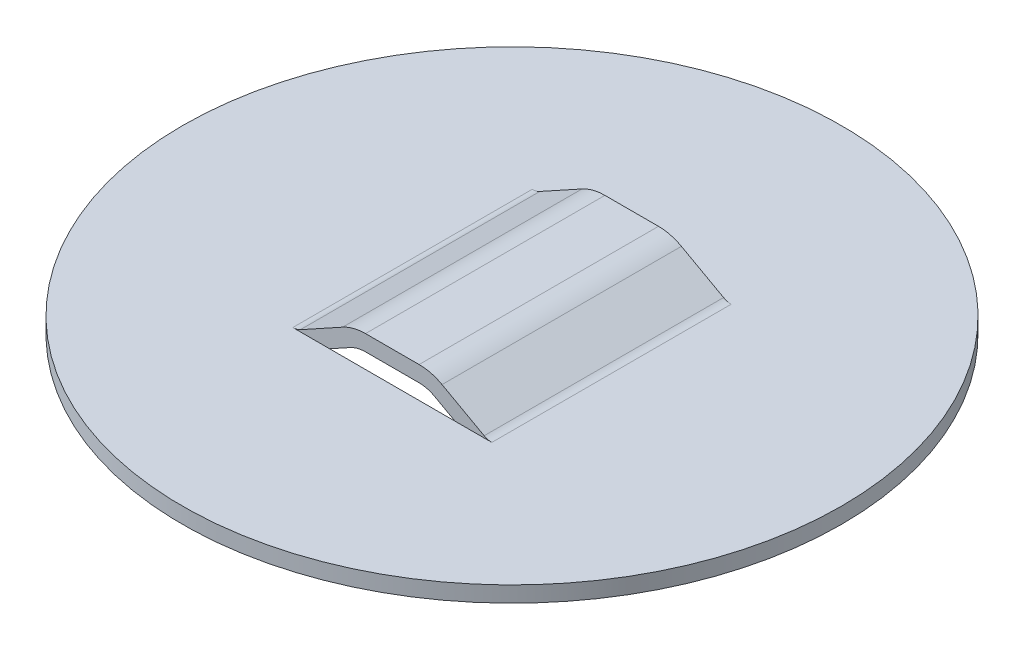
ISO-10303-21;
HEADER;
FILE_DESCRIPTION(('STEP AP214'),'2;1');
FILE_NAME('part.step','',(''),(''),'','','');
FILE_SCHEMA(('AUTOMOTIVE_DESIGN { 1 0 10303 214 1 1 1 1 }'));
ENDSEC;
DATA;
#1=APPLICATION_CONTEXT('core data for automotive mechanical design processes');
#2=APPLICATION_PROTOCOL_DEFINITION('international standard','automotive_design',2000,#1);
#3=PRODUCT_CONTEXT('',#1,'mechanical');
#4=PRODUCT('Part','Part','',(#3));
#5=PRODUCT_RELATED_PRODUCT_CATEGORY('part','',(#4));
#6=PRODUCT_DEFINITION_FORMATION('','',#4);
#7=PRODUCT_DEFINITION_CONTEXT('part definition',#1,'design');
#8=PRODUCT_DEFINITION('design','',#6,#7);
#9=PRODUCT_DEFINITION_SHAPE('','',#8);
#10=(LENGTH_UNIT() NAMED_UNIT(*) SI_UNIT(.MILLI.,.METRE.));
#11=(NAMED_UNIT(*) PLANE_ANGLE_UNIT() SI_UNIT($,.RADIAN.));
#12=(NAMED_UNIT(*) SI_UNIT($,.STERADIAN.) SOLID_ANGLE_UNIT());
#13=UNCERTAINTY_MEASURE_WITH_UNIT(LENGTH_MEASURE(1.E-05),#10,'distance_accuracy_value','');
#14=(GEOMETRIC_REPRESENTATION_CONTEXT(3) GLOBAL_UNCERTAINTY_ASSIGNED_CONTEXT((#13)) GLOBAL_UNIT_ASSIGNED_CONTEXT((#10,
#11,#12)) REPRESENTATION_CONTEXT('',''));
#15=CARTESIAN_POINT('',(0.,0.,0.));
#16=DIRECTION('',(0.,0.,1.));
#17=DIRECTION('',(1.,0.,0.));
#18=AXIS2_PLACEMENT_3D('',#15,#16,#17);
#19=CARTESIAN_POINT('',(1.29111466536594,0.7366,11.5316));
#20=DIRECTION('',(0.,1.,0.));
#21=DIRECTION('',(-1.,0.,0.));
#22=AXIS2_PLACEMENT_3D('',#19,#20,#21);
#23=PLANE('',#22);
#24=DIRECTION('',(0.,0.,-1.));
#25=VECTOR('',#24,1.);
#26=CARTESIAN_POINT('',(1.29111466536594,0.7366,11.5316));
#27=LINE('',#26,#25);
#28=CARTESIAN_POINT('',(1.29111466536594,0.7366,0.));
#29=VERTEX_POINT('',#28);
#30=CARTESIAN_POINT('',(1.29111466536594,0.7366,11.5316));
#31=VERTEX_POINT('',#30);
#32=EDGE_CURVE('E137',#29,#31,#27,.F.);
#33=ORIENTED_EDGE('',*,*,#32,.T.);
#34=DIRECTION('',(-1.,0.,0.));
#35=VECTOR('',#34,1.);
#36=CARTESIAN_POINT('',(-1.29111466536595,0.7366,11.5316));
#37=LINE('',#36,#35);
#38=CARTESIAN_POINT('',(-1.29111466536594,0.7366,11.5316));
#39=VERTEX_POINT('',#38);
#40=EDGE_CURVE('E195',#31,#39,#37,.T.);
#41=ORIENTED_EDGE('',*,*,#40,.T.);
#42=DIRECTION('',(0.,0.,-1.));
#43=VECTOR('',#42,1.);
#44=CARTESIAN_POINT('',(-1.29111466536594,0.7366,11.5316));
#45=LINE('',#44,#43);
#46=CARTESIAN_POINT('',(-1.29111466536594,0.7366,0.));
#47=VERTEX_POINT('',#46);
#48=EDGE_CURVE('E155',#39,#47,#45,.T.);
#49=ORIENTED_EDGE('',*,*,#48,.T.);
#50=DIRECTION('',(-1.,0.,0.));
#51=VECTOR('',#50,1.);
#52=CARTESIAN_POINT('',(-1.29111466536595,0.7366,0.));
#53=LINE('',#52,#51);
#54=EDGE_CURVE('E157',#29,#47,#53,.T.);
#55=ORIENTED_EDGE('',*,*,#54,.F.);
#56=EDGE_LOOP('',(#33,#41,#49,#55));
#57=FACE_BOUND('',#56,.T.);
#58=ADVANCED_FACE('F18',(#57),#23,.F.);
#59=CARTESIAN_POINT('',(-4.5974,0.,11.5316));
#60=DIRECTION('',(0.48286097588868,-0.875697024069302,0.));
#61=DIRECTION('',(0.875697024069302,0.48286097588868,0.));
#62=AXIS2_PLACEMENT_3D('',#59,#60,#61);
#63=PLANE('',#62);
#64=DIRECTION('',(0.,0.,1.));
#65=VECTOR('',#64,1.);
#66=CARTESIAN_POINT('',(-4.42562171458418,0.0947188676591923,11.5316));
#67=LINE('',#66,#65);
#68=CARTESIAN_POINT('',(-4.42562171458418,0.094718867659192,0.));
#69=VERTEX_POINT('',#68);
#70=CARTESIAN_POINT('',(-4.42562171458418,0.094718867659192,11.5316));
#71=VERTEX_POINT('',#70);
#72=EDGE_CURVE('E138',#69,#71,#67,.T.);
#73=ORIENTED_EDGE('',*,*,#72,.T.);
#74=DIRECTION('',(0.875697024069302,0.48286097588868,0.));
#75=VECTOR('',#74,1.);
#76=CARTESIAN_POINT('',(-4.42562171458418,0.0947188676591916,11.5316));
#77=LINE('',#76,#75);
#78=CARTESIAN_POINT('',(-2.39493485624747,1.21444339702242,11.5316));
#79=VERTEX_POINT('',#78);
#80=EDGE_CURVE('E188',#71,#79,#77,.T.);
#81=ORIENTED_EDGE('',*,*,#80,.T.);
#82=DIRECTION('',(0.,0.,-1.));
#83=VECTOR('',#82,1.);
#84=CARTESIAN_POINT('',(-2.39493485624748,1.21444339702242,11.5316));
#85=LINE('',#84,#83);
#86=CARTESIAN_POINT('',(-2.39493485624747,1.21444339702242,0.));
#87=VERTEX_POINT('',#86);
#88=EDGE_CURVE('E275',#87,#79,#85,.F.);
#89=ORIENTED_EDGE('',*,*,#88,.F.);
#90=DIRECTION('',(0.875697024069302,0.48286097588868,0.));
#91=VECTOR('',#90,1.);
#92=CARTESIAN_POINT('',(-4.42562171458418,0.0947188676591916,0.));
#93=LINE('',#92,#91);
#94=EDGE_CURVE('E202',#69,#87,#93,.T.);
#95=ORIENTED_EDGE('',*,*,#94,.F.);
#96=EDGE_LOOP('',(#73,#81,#89,#95));
#97=FACE_BOUND('',#96,.T.);
#98=ADVANCED_FACE('F290',(#97),#63,.F.);
#99=CARTESIAN_POINT('',(-1.29111466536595,-0.7874,11.5316));
#100=DIRECTION('',(0.,0.,-1.));
#101=DIRECTION('',(-1.,0.,0.));
#102=AXIS2_PLACEMENT_3D('',#99,#100,#101);
#103=CYLINDRICAL_SURFACE('',#102,2.286);
#104=CARTESIAN_POINT('',(-1.29111466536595,-0.7874,11.5316));
#105=DIRECTION('',(0.,0.,-1.));
#106=DIRECTION('',(-1.,0.,0.));
#107=AXIS2_PLACEMENT_3D('',#104,#105,#106);
#108=CIRCLE('',#107,2.286);
#109=CARTESIAN_POINT('',(-1.29111466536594,1.4986,11.5316));
#110=VERTEX_POINT('',#109);
#111=EDGE_CURVE('E185',#79,#110,#108,.T.);
#112=ORIENTED_EDGE('',*,*,#111,.T.);
#113=DIRECTION('',(0.,0.,-1.));
#114=VECTOR('',#113,1.);
#115=CARTESIAN_POINT('',(-1.29111466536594,1.4986,11.5316));
#116=LINE('',#115,#114);
#117=CARTESIAN_POINT('',(-1.29111466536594,1.4986,0.));
#118=VERTEX_POINT('',#117);
#119=EDGE_CURVE('E273',#110,#118,#116,.T.);
#120=ORIENTED_EDGE('',*,*,#119,.T.);
#121=CARTESIAN_POINT('',(-1.29111466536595,-0.7874,0.));
#122=DIRECTION('',(0.,0.,-1.));
#123=DIRECTION('',(-1.,0.,0.));
#124=AXIS2_PLACEMENT_3D('',#121,#122,#123);
#125=CIRCLE('',#124,2.286);
#126=EDGE_CURVE('E200',#87,#118,#125,.T.);
#127=ORIENTED_EDGE('',*,*,#126,.F.);
#128=ORIENTED_EDGE('',*,*,#88,.T.);
#129=EDGE_LOOP('',(#112,#120,#127,#128));
#130=FACE_BOUND('',#129,.T.);
#131=ADVANCED_FACE('F280',(#130),#103,.T.);
#132=CARTESIAN_POINT('',(-1.29111466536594,1.4986,11.5316));
#133=DIRECTION('',(0.,-1.,0.));
#134=DIRECTION('',(0.,0.,-1.));
#135=AXIS2_PLACEMENT_3D('',#132,#133,#134);
#136=PLANE('',#135);
#137=ORIENTED_EDGE('',*,*,#119,.F.);
#138=DIRECTION('',(-1.,0.,0.));
#139=VECTOR('',#138,1.);
#140=CARTESIAN_POINT('',(-1.29111466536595,1.4986,11.5316));
#141=LINE('',#140,#139);
#142=CARTESIAN_POINT('',(1.29111466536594,1.4986,11.5316));
#143=VERTEX_POINT('',#142);
#144=EDGE_CURVE('E184',#110,#143,#141,.F.);
#145=ORIENTED_EDGE('',*,*,#144,.T.);
#146=DIRECTION('',(0.,0.,-1.));
#147=VECTOR('',#146,1.);
#148=CARTESIAN_POINT('',(1.29111466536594,1.4986,11.5316));
#149=LINE('',#148,#147);
#150=CARTESIAN_POINT('',(1.29111466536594,1.4986,0.));
#151=VERTEX_POINT('',#150);
#152=EDGE_CURVE('E271',#151,#143,#149,.F.);
#153=ORIENTED_EDGE('',*,*,#152,.F.);
#154=DIRECTION('',(-1.,0.,0.));
#155=VECTOR('',#154,1.);
#156=CARTESIAN_POINT('',(-1.29111466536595,1.4986,0.));
#157=LINE('',#156,#155);
#158=EDGE_CURVE('E199',#118,#151,#157,.F.);
#159=ORIENTED_EDGE('',*,*,#158,.F.);
#160=EDGE_LOOP('',(#137,#145,#153,#159));
#161=FACE_BOUND('',#160,.T.);
#162=ADVANCED_FACE('F321',(#161),#136,.F.);
#163=CARTESIAN_POINT('',(1.29111466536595,-0.787399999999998,11.5316));
#164=DIRECTION('',(0.,0.,-1.));
#165=DIRECTION('',(-1.,0.,0.));
#166=AXIS2_PLACEMENT_3D('',#163,#164,#165);
#167=CYLINDRICAL_SURFACE('',#166,2.286);
#168=CARTESIAN_POINT('',(1.29111466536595,-0.787399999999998,11.5316));
#169=DIRECTION('',(0.,0.,-1.));
#170=DIRECTION('',(-1.,0.,0.));
#171=AXIS2_PLACEMENT_3D('',#168,#169,#170);
#172=CIRCLE('',#171,2.286);
#173=CARTESIAN_POINT('',(2.39493485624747,1.21444339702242,11.5316));
#174=VERTEX_POINT('',#173);
#175=EDGE_CURVE('E181',#143,#174,#172,.T.);
#176=ORIENTED_EDGE('',*,*,#175,.T.);
#177=DIRECTION('',(0.,0.,1.));
#178=VECTOR('',#177,1.);
#179=CARTESIAN_POINT('',(2.39493485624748,1.21444339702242,11.5316));
#180=LINE('',#179,#178);
#181=CARTESIAN_POINT('',(2.39493485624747,1.21444339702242,0.));
#182=VERTEX_POINT('',#181);
#183=EDGE_CURVE('E269',#174,#182,#180,.F.);
#184=ORIENTED_EDGE('',*,*,#183,.T.);
#185=CARTESIAN_POINT('',(1.29111466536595,-0.787399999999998,0.));
#186=DIRECTION('',(0.,0.,-1.));
#187=DIRECTION('',(-1.,0.,0.));
#188=AXIS2_PLACEMENT_3D('',#185,#186,#187);
#189=CIRCLE('',#188,2.286);
#190=EDGE_CURVE('E146',#151,#182,#189,.T.);
#191=ORIENTED_EDGE('',*,*,#190,.F.);
#192=ORIENTED_EDGE('',*,*,#152,.T.);
#193=EDGE_LOOP('',(#176,#184,#191,#192));
#194=FACE_BOUND('',#193,.T.);
#195=ADVANCED_FACE('F323',(#194),#167,.T.);
#196=CARTESIAN_POINT('',(4.5974,0.,11.5316));
#197=DIRECTION('',(-0.48286097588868,-0.875697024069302,0.));
#198=DIRECTION('',(0.875697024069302,-0.48286097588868,0.));
#199=AXIS2_PLACEMENT_3D('',#196,#197,#198);
#200=PLANE('',#199);
#201=DIRECTION('',(0.,0.,1.));
#202=VECTOR('',#201,1.);
#203=CARTESIAN_POINT('',(4.42562171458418,0.094718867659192,11.5316));
#204=LINE('',#203,#202);
#205=CARTESIAN_POINT('',(4.42562171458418,0.0947188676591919,11.5316));
#206=VERTEX_POINT('',#205);
#207=CARTESIAN_POINT('',(4.42562171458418,0.0947188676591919,0.));
#208=VERTEX_POINT('',#207);
#209=EDGE_CURVE('E128',#206,#208,#204,.F.);
#210=ORIENTED_EDGE('',*,*,#209,.T.);
#211=DIRECTION('',(0.875697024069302,-0.482860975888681,0.));
#212=VECTOR('',#211,1.);
#213=CARTESIAN_POINT('',(2.39493485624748,1.21444339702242,0.));
#214=LINE('',#213,#212);
#215=EDGE_CURVE('E131',#182,#208,#214,.T.);
#216=ORIENTED_EDGE('',*,*,#215,.F.);
#217=ORIENTED_EDGE('',*,*,#183,.F.);
#218=DIRECTION('',(0.875697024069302,-0.482860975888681,0.));
#219=VECTOR('',#218,1.);
#220=CARTESIAN_POINT('',(2.39493485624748,1.21444339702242,11.5316));
#221=LINE('',#220,#219);
#222=EDGE_CURVE('E133',#174,#206,#221,.T.);
#223=ORIENTED_EDGE('',*,*,#222,.T.);
#224=EDGE_LOOP('',(#210,#216,#217,#223));
#225=FACE_BOUND('',#224,.T.);
#226=ADVANCED_FACE('F130',(#225),#200,.F.);
#227=CARTESIAN_POINT('',(-4.79356177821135,0.762,11.5316));
#228=DIRECTION('',(0.,0.,1.));
#229=DIRECTION('',(1.,0.,0.));
#230=AXIS2_PLACEMENT_3D('',#227,#228,#229);
#231=CYLINDRICAL_SURFACE('',#230,0.762);
#232=ORIENTED_EDGE('',*,*,#72,.F.);
#233=CARTESIAN_POINT('',(-4.79356177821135,0.762,0.));
#234=DIRECTION('',(0.,0.,1.));
#235=DIRECTION('',(1.,0.,0.));
#236=AXIS2_PLACEMENT_3D('',#233,#234,#235);
#237=CIRCLE('',#236,0.762);
#238=CARTESIAN_POINT('',(-4.79356177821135,0.,0.));
#239=VERTEX_POINT('',#238);
#240=EDGE_CURVE('E203',#239,#69,#237,.T.);
#241=ORIENTED_EDGE('',*,*,#240,.F.);
#242=DIRECTION('',(0.,0.,1.));
#243=VECTOR('',#242,1.);
#244=CARTESIAN_POINT('',(-4.79356177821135,0.,11.5316));
#245=LINE('',#244,#243);
#246=CARTESIAN_POINT('',(-4.79356177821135,0.,11.5316));
#247=VERTEX_POINT('',#246);
#248=EDGE_CURVE('E226',#239,#247,#245,.T.);
#249=ORIENTED_EDGE('',*,*,#248,.T.);
#250=CARTESIAN_POINT('',(-4.79356177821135,0.762,11.5316));
#251=DIRECTION('',(0.,0.,1.));
#252=DIRECTION('',(1.,0.,0.));
#253=AXIS2_PLACEMENT_3D('',#250,#251,#252);
#254=CIRCLE('',#253,0.762);
#255=EDGE_CURVE('E189',#247,#71,#254,.T.);
#256=ORIENTED_EDGE('',*,*,#255,.T.);
#257=EDGE_LOOP('',(#232,#241,#249,#256));
#258=FACE_BOUND('',#257,.T.);
#259=ADVANCED_FACE('F354',(#258),#231,.F.);
#260=CARTESIAN_POINT('',(4.79356177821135,0.761999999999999,11.5316));
#261=DIRECTION('',(0.,0.,1.));
#262=DIRECTION('',(1.,0.,0.));
#263=AXIS2_PLACEMENT_3D('',#260,#261,#262);
#264=CYLINDRICAL_SURFACE('',#263,0.762);
#265=DIRECTION('',(0.,0.,1.));
#266=VECTOR('',#265,1.);
#267=CARTESIAN_POINT('',(4.79356177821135,0.,11.5316));
#268=LINE('',#267,#266);
#269=CARTESIAN_POINT('',(4.79356177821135,0.,11.5316));
#270=VERTEX_POINT('',#269);
#271=CARTESIAN_POINT('',(4.79356177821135,0.,0.));
#272=VERTEX_POINT('',#271);
#273=EDGE_CURVE('E153',#270,#272,#268,.F.);
#274=ORIENTED_EDGE('',*,*,#273,.T.);
#275=CARTESIAN_POINT('',(4.79356177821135,0.761999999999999,0.));
#276=DIRECTION('',(0.,0.,1.));
#277=DIRECTION('',(1.,0.,0.));
#278=AXIS2_PLACEMENT_3D('',#275,#276,#277);
#279=CIRCLE('',#278,0.762);
#280=EDGE_CURVE('E21',#208,#272,#279,.T.);
#281=ORIENTED_EDGE('',*,*,#280,.F.);
#282=ORIENTED_EDGE('',*,*,#209,.F.);
#283=CARTESIAN_POINT('',(4.79356177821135,0.761999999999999,11.5316));
#284=DIRECTION('',(0.,0.,1.));
#285=DIRECTION('',(1.,0.,0.));
#286=AXIS2_PLACEMENT_3D('',#283,#284,#285);
#287=CIRCLE('',#286,0.762);
#288=EDGE_CURVE('E178',#206,#270,#287,.T.);
#289=ORIENTED_EDGE('',*,*,#288,.T.);
#290=EDGE_LOOP('',(#274,#281,#282,#289));
#291=FACE_BOUND('',#290,.T.);
#292=ADVANCED_FACE('F151',(#291),#264,.F.);
#293=CARTESIAN_POINT('',(1.29111466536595,-0.787399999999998,11.5316));
#294=DIRECTION('',(0.,0.,-1.));
#295=DIRECTION('',(-1.,0.,0.));
#296=AXIS2_PLACEMENT_3D('',#293,#294,#295);
#297=CYLINDRICAL_SURFACE('',#296,1.524);
#298=DIRECTION('',(0.,0.,1.));
#299=VECTOR('',#298,1.);
#300=CARTESIAN_POINT('',(2.0269947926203,0.547162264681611,11.5316));
#301=LINE('',#300,#299);
#302=CARTESIAN_POINT('',(2.0269947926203,0.547162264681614,0.));
#303=VERTEX_POINT('',#302);
#304=CARTESIAN_POINT('',(2.0269947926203,0.547162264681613,11.5316));
#305=VERTEX_POINT('',#304);
#306=EDGE_CURVE('E176',#303,#305,#301,.T.);
#307=ORIENTED_EDGE('',*,*,#306,.T.);
#308=CARTESIAN_POINT('',(1.29111466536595,-0.787399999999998,11.5316));
#309=DIRECTION('',(0.,0.,-1.));
#310=DIRECTION('',(-1.,0.,0.));
#311=AXIS2_PLACEMENT_3D('',#308,#309,#310);
#312=CIRCLE('',#311,1.524);
#313=EDGE_CURVE('E148',#305,#31,#312,.F.);
#314=ORIENTED_EDGE('',*,*,#313,.T.);
#315=ORIENTED_EDGE('',*,*,#32,.F.);
#316=CARTESIAN_POINT('',(1.29111466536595,-0.787399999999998,0.));
#317=DIRECTION('',(0.,0.,-1.));
#318=DIRECTION('',(-1.,0.,0.));
#319=AXIS2_PLACEMENT_3D('',#316,#317,#318);
#320=CIRCLE('',#319,1.524);
#321=EDGE_CURVE('E154',#303,#29,#320,.F.);
#322=ORIENTED_EDGE('',*,*,#321,.F.);
#323=EDGE_LOOP('',(#307,#314,#315,#322));
#324=FACE_BOUND('',#323,.T.);
#325=ADVANCED_FACE('F344',(#324),#297,.F.);
#326=CARTESIAN_POINT('',(-1.29111466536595,-0.7874,11.5316));
#327=DIRECTION('',(0.,0.,-1.));
#328=DIRECTION('',(-1.,0.,0.));
#329=AXIS2_PLACEMENT_3D('',#326,#327,#328);
#330=CYLINDRICAL_SURFACE('',#329,1.524);
#331=ORIENTED_EDGE('',*,*,#48,.F.);
#332=CARTESIAN_POINT('',(-1.29111466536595,-0.7874,11.5316));
#333=DIRECTION('',(0.,0.,-1.));
#334=DIRECTION('',(-1.,0.,0.));
#335=AXIS2_PLACEMENT_3D('',#332,#333,#334);
#336=CIRCLE('',#335,1.524);
#337=CARTESIAN_POINT('',(-2.0269947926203,0.547162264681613,11.5316));
#338=VERTEX_POINT('',#337);
#339=EDGE_CURVE('E192',#39,#338,#336,.F.);
#340=ORIENTED_EDGE('',*,*,#339,.T.);
#341=DIRECTION('',(0.,0.,1.));
#342=VECTOR('',#341,1.);
#343=CARTESIAN_POINT('',(-2.0269947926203,0.547162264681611,11.5316));
#344=LINE('',#343,#342);
#345=CARTESIAN_POINT('',(-2.0269947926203,0.547162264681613,0.));
#346=VERTEX_POINT('',#345);
#347=EDGE_CURVE('E216',#338,#346,#344,.F.);
#348=ORIENTED_EDGE('',*,*,#347,.T.);
#349=CARTESIAN_POINT('',(-1.29111466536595,-0.7874,0.));
#350=DIRECTION('',(0.,0.,-1.));
#351=DIRECTION('',(-1.,0.,0.));
#352=AXIS2_PLACEMENT_3D('',#349,#350,#351);
#353=CIRCLE('',#352,1.524);
#354=EDGE_CURVE('E206',#47,#346,#353,.F.);
#355=ORIENTED_EDGE('',*,*,#354,.F.);
#356=EDGE_LOOP('',(#331,#340,#348,#355));
#357=FACE_BOUND('',#356,.T.);
#358=ADVANCED_FACE('F387',(#357),#330,.F.);
#359=CARTESIAN_POINT('',(-1.29111466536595,-0.7874,0.));
#360=DIRECTION('',(0.,0.,-1.));
#361=DIRECTION('',(-1.,0.,0.));
#362=AXIS2_PLACEMENT_3D('',#359,#360,#361);
#363=PLANE('',#362);
#364=ORIENTED_EDGE('',*,*,#190,.T.);
#365=ORIENTED_EDGE('',*,*,#215,.T.);
#366=ORIENTED_EDGE('',*,*,#280,.T.);
#367=DIRECTION('',(1.,0.,0.));
#368=VECTOR('',#367,1.);
#369=CARTESIAN_POINT('',(12.242254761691,0.,0.));
#370=LINE('',#369,#368);
#371=CARTESIAN_POINT('',(3.01930601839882,0.,0.));
#372=VERTEX_POINT('',#371);
#373=EDGE_CURVE('E177',#272,#372,#370,.F.);
#374=ORIENTED_EDGE('',*,*,#373,.T.);
#375=DIRECTION('',(-0.875697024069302,0.482860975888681,0.));
#376=VECTOR('',#375,1.);
#377=CARTESIAN_POINT('',(4.40123822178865,-0.762000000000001,0.));
#378=LINE('',#377,#376);
#379=EDGE_CURVE('E244',#372,#303,#378,.T.);
#380=ORIENTED_EDGE('',*,*,#379,.T.);
#381=ORIENTED_EDGE('',*,*,#321,.T.);
#382=ORIENTED_EDGE('',*,*,#54,.T.);
#383=ORIENTED_EDGE('',*,*,#354,.T.);
#384=DIRECTION('',(-0.875697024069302,-0.48286097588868,0.));
#385=VECTOR('',#384,1.);
#386=CARTESIAN_POINT('',(-4.40123822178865,-0.762,0.));
#387=LINE('',#386,#385);
#388=CARTESIAN_POINT('',(-3.01930601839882,0.,0.));
#389=VERTEX_POINT('',#388);
#390=EDGE_CURVE('E213',#346,#389,#387,.T.);
#391=ORIENTED_EDGE('',*,*,#390,.T.);
#392=DIRECTION('',(1.,0.,0.));
#393=VECTOR('',#392,1.);
#394=CARTESIAN_POINT('',(12.242254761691,0.,0.));
#395=LINE('',#394,#393);
#396=EDGE_CURVE('E180',#389,#239,#395,.F.);
#397=ORIENTED_EDGE('',*,*,#396,.T.);
#398=ORIENTED_EDGE('',*,*,#240,.T.);
#399=ORIENTED_EDGE('',*,*,#94,.T.);
#400=ORIENTED_EDGE('',*,*,#126,.T.);
#401=ORIENTED_EDGE('',*,*,#158,.T.);
#402=EDGE_LOOP('',(#364,#365,#366,#374,#380,#381,#382,#383,#391,#397,#398,#399,#400,#401));
#403=FACE_BOUND('',#402,.T.);
#404=ADVANCED_FACE('F142',(#403),#363,.T.);
#405=CARTESIAN_POINT('',(-1.29111466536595,-0.7874,11.5316));
#406=DIRECTION('',(0.,0.,-1.));
#407=DIRECTION('',(-1.,0.,0.));
#408=AXIS2_PLACEMENT_3D('',#405,#406,#407);
#409=PLANE('',#408);
#410=ORIENTED_EDGE('',*,*,#288,.F.);
#411=ORIENTED_EDGE('',*,*,#222,.F.);
#412=ORIENTED_EDGE('',*,*,#175,.F.);
#413=ORIENTED_EDGE('',*,*,#144,.F.);
#414=ORIENTED_EDGE('',*,*,#111,.F.);
#415=ORIENTED_EDGE('',*,*,#80,.F.);
#416=ORIENTED_EDGE('',*,*,#255,.F.);
#417=DIRECTION('',(1.,0.,0.));
#418=VECTOR('',#417,1.);
#419=CARTESIAN_POINT('',(12.242254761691,0.,11.5316));
#420=LINE('',#419,#418);
#421=CARTESIAN_POINT('',(-3.01930601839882,0.,11.5316));
#422=VERTEX_POINT('',#421);
#423=EDGE_CURVE('E232',#247,#422,#420,.T.);
#424=ORIENTED_EDGE('',*,*,#423,.T.);
#425=DIRECTION('',(-0.875697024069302,-0.48286097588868,0.));
#426=VECTOR('',#425,1.);
#427=CARTESIAN_POINT('',(-4.40123822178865,-0.762,11.5316));
#428=LINE('',#427,#426);
#429=EDGE_CURVE('E221',#422,#338,#428,.F.);
#430=ORIENTED_EDGE('',*,*,#429,.T.);
#431=ORIENTED_EDGE('',*,*,#339,.F.);
#432=ORIENTED_EDGE('',*,*,#40,.F.);
#433=ORIENTED_EDGE('',*,*,#313,.F.);
#434=DIRECTION('',(-0.875697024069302,0.482860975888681,0.));
#435=VECTOR('',#434,1.);
#436=CARTESIAN_POINT('',(4.40123822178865,-0.762000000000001,11.5316));
#437=LINE('',#436,#435);
#438=CARTESIAN_POINT('',(3.01930601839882,0.,11.5316));
#439=VERTEX_POINT('',#438);
#440=EDGE_CURVE('E241',#305,#439,#437,.F.);
#441=ORIENTED_EDGE('',*,*,#440,.T.);
#442=DIRECTION('',(1.,0.,0.));
#443=VECTOR('',#442,1.);
#444=CARTESIAN_POINT('',(12.242254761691,0.,11.5316));
#445=LINE('',#444,#443);
#446=EDGE_CURVE('E234',#439,#270,#445,.T.);
#447=ORIENTED_EDGE('',*,*,#446,.T.);
#448=EDGE_LOOP('',(#410,#411,#412,#413,#414,#415,#416,#424,#430,#431,#432,#433,#441,#447));
#449=FACE_BOUND('',#448,.T.);
#450=ADVANCED_FACE('F287',(#449),#409,.F.);
#451=CARTESIAN_POINT('',(12.242254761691,0.,11.5316));
#452=DIRECTION('',(0.,-1.,0.));
#453=DIRECTION('',(1.,0.,0.));
#454=AXIS2_PLACEMENT_3D('',#451,#452,#453);
#455=PLANE('',#454);
#456=ORIENTED_EDGE('',*,*,#373,.F.);
#457=ORIENTED_EDGE('',*,*,#273,.F.);
#458=ORIENTED_EDGE('',*,*,#446,.F.);
#459=DIRECTION('',(1.,0.,0.));
#460=VECTOR('',#459,1.);
#461=CARTESIAN_POINT('',(-1.29111466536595,0.,11.5316));
#462=LINE('',#461,#460);
#463=EDGE_CURVE('E250',#439,#422,#462,.F.);
#464=ORIENTED_EDGE('',*,*,#463,.T.);
#465=ORIENTED_EDGE('',*,*,#423,.F.);
#466=ORIENTED_EDGE('',*,*,#248,.F.);
#467=ORIENTED_EDGE('',*,*,#396,.F.);
#468=DIRECTION('',(1.,0.,0.));
#469=VECTOR('',#468,1.);
#470=CARTESIAN_POINT('',(-1.29111466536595,0.,0.));
#471=LINE('',#470,#469);
#472=EDGE_CURVE('E219',#372,#389,#471,.F.);
#473=ORIENTED_EDGE('',*,*,#472,.F.);
#474=EDGE_LOOP('',(#456,#457,#458,#464,#465,#466,#467,#473));
#475=FACE_BOUND('',#474,.T.);
#476=CARTESIAN_POINT('',(0.,0.,5.7658));
#477=DIRECTION('',(0.,-1.,0.));
#478=DIRECTION('',(1.,0.,0.));
#479=AXIS2_PLACEMENT_3D('',#476,#477,#478);
#480=CIRCLE('',#479,15.875);
#481=CARTESIAN_POINT('',(15.875,0.,5.7658));
#482=VERTEX_POINT('',#481);
#483=EDGE_CURVE('E173',#482,#482,#480,.T.);
#484=ORIENTED_EDGE('',*,*,#483,.F.);
#485=EDGE_LOOP('',(#484));
#486=FACE_BOUND('',#485,.T.);
#487=ADVANCED_FACE('F347',(#475,#486),#455,.F.);
#488=CARTESIAN_POINT('',(0.,0.,5.7658));
#489=DIRECTION('',(0.,-1.,0.));
#490=DIRECTION('',(1.,0.,0.));
#491=AXIS2_PLACEMENT_3D('',#488,#489,#490);
#492=CYLINDRICAL_SURFACE('',#491,15.875);
#493=CARTESIAN_POINT('',(0.,-0.762000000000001,5.7658));
#494=DIRECTION('',(0.,-1.,0.));
#495=DIRECTION('',(1.,0.,0.));
#496=AXIS2_PLACEMENT_3D('',#493,#494,#495);
#497=CIRCLE('',#496,15.875);
#498=CARTESIAN_POINT('',(15.875,-0.761999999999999,5.7658));
#499=VERTEX_POINT('',#498);
#500=EDGE_CURVE('E168',#499,#499,#497,.F.);
#501=ORIENTED_EDGE('',*,*,#500,.T.);
#502=EDGE_LOOP('',(#501));
#503=FACE_BOUND('',#502,.T.);
#504=ORIENTED_EDGE('',*,*,#483,.T.);
#505=EDGE_LOOP('',(#504));
#506=FACE_BOUND('',#505,.T.);
#507=ADVANCED_FACE('F377',(#503,#506),#492,.T.);
#508=CARTESIAN_POINT('',(4.40123822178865,-0.762000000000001,11.5316));
#509=DIRECTION('',(0.482860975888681,0.875697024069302,0.));
#510=DIRECTION('',(-0.875697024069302,0.482860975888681,0.));
#511=AXIS2_PLACEMENT_3D('',#508,#509,#510);
#512=PLANE('',#511);
#513=DIRECTION('',(-0.875697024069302,0.48286097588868,0.));
#514=VECTOR('',#513,1.);
#515=CARTESIAN_POINT('',(4.40123822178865,-0.762000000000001,0.));
#516=LINE('',#515,#514);
#517=CARTESIAN_POINT('',(4.40123822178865,-0.762000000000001,0.));
#518=VERTEX_POINT('',#517);
#519=EDGE_CURVE('E172',#518,#372,#516,.T.);
#520=ORIENTED_EDGE('',*,*,#519,.F.);
#521=DIRECTION('',(0.,0.,1.));
#522=VECTOR('',#521,1.);
#523=CARTESIAN_POINT('',(4.40123822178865,-0.762000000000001,11.5316));
#524=LINE('',#523,#522);
#525=CARTESIAN_POINT('',(4.40123822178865,-0.762000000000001,11.5316));
#526=VERTEX_POINT('',#525);
#527=EDGE_CURVE('E171',#518,#526,#524,.T.);
#528=ORIENTED_EDGE('',*,*,#527,.T.);
#529=DIRECTION('',(-0.875697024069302,0.48286097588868,0.));
#530=VECTOR('',#529,1.);
#531=CARTESIAN_POINT('',(4.40123822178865,-0.762000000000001,11.5316));
#532=LINE('',#531,#530);
#533=EDGE_CURVE('E247',#526,#439,#532,.T.);
#534=ORIENTED_EDGE('',*,*,#533,.T.);
#535=ORIENTED_EDGE('',*,*,#440,.F.);
#536=ORIENTED_EDGE('',*,*,#306,.F.);
#537=ORIENTED_EDGE('',*,*,#379,.F.);
#538=EDGE_LOOP('',(#520,#528,#534,#535,#536,#537));
#539=FACE_BOUND('',#538,.T.);
#540=ADVANCED_FACE('F328',(#539),#512,.F.);
#541=CARTESIAN_POINT('',(-1.29111466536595,-0.7874,11.5316));
#542=DIRECTION('',(0.,0.,1.));
#543=DIRECTION('',(1.,0.,0.));
#544=AXIS2_PLACEMENT_3D('',#541,#542,#543);
#545=PLANE('',#544);
#546=DIRECTION('',(-1.,0.,0.));
#547=VECTOR('',#546,1.);
#548=CARTESIAN_POINT('',(12.242254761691,-0.762,11.5316));
#549=LINE('',#548,#547);
#550=CARTESIAN_POINT('',(-4.40123822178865,-0.762,11.5316));
#551=VERTEX_POINT('',#550);
#552=EDGE_CURVE('E312',#526,#551,#549,.T.);
#553=ORIENTED_EDGE('',*,*,#552,.T.);
#554=DIRECTION('',(-0.875697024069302,-0.48286097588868,0.));
#555=VECTOR('',#554,1.);
#556=CARTESIAN_POINT('',(-4.40123822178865,-0.762,11.5316));
#557=LINE('',#556,#555);
#558=EDGE_CURVE('E215',#551,#422,#557,.F.);
#559=ORIENTED_EDGE('',*,*,#558,.T.);
#560=ORIENTED_EDGE('',*,*,#463,.F.);
#561=ORIENTED_EDGE('',*,*,#533,.F.);
#562=EDGE_LOOP('',(#553,#559,#560,#561));
#563=FACE_BOUND('',#562,.T.);
#564=ADVANCED_FACE('F336',(#563),#545,.F.);
#565=CARTESIAN_POINT('',(-4.40123822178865,-0.762,11.5316));
#566=DIRECTION('',(-0.48286097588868,0.875697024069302,0.));
#567=DIRECTION('',(-0.875697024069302,-0.48286097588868,0.));
#568=AXIS2_PLACEMENT_3D('',#565,#566,#567);
#569=PLANE('',#568);
#570=ORIENTED_EDGE('',*,*,#558,.F.);
#571=DIRECTION('',(0.,0.,1.));
#572=VECTOR('',#571,1.);
#573=CARTESIAN_POINT('',(-4.40123822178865,-0.762000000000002,11.5316));
#574=LINE('',#573,#572);
#575=CARTESIAN_POINT('',(-4.40123822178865,-0.762000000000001,0.));
#576=VERTEX_POINT('',#575);
#577=EDGE_CURVE('E27',#551,#576,#574,.F.);
#578=ORIENTED_EDGE('',*,*,#577,.T.);
#579=DIRECTION('',(-0.875697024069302,-0.482860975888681,0.));
#580=VECTOR('',#579,1.);
#581=CARTESIAN_POINT('',(-3.01930601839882,0.,0.));
#582=LINE('',#581,#580);
#583=EDGE_CURVE('E35',#389,#576,#582,.T.);
#584=ORIENTED_EDGE('',*,*,#583,.F.);
#585=ORIENTED_EDGE('',*,*,#390,.F.);
#586=ORIENTED_EDGE('',*,*,#347,.F.);
#587=ORIENTED_EDGE('',*,*,#429,.F.);
#588=EDGE_LOOP('',(#570,#578,#584,#585,#586,#587));
#589=FACE_BOUND('',#588,.T.);
#590=ADVANCED_FACE('F351',(#589),#569,.F.);
#591=CARTESIAN_POINT('',(-1.29111466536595,-0.7874,0.));
#592=DIRECTION('',(0.,0.,1.));
#593=DIRECTION('',(1.,0.,0.));
#594=AXIS2_PLACEMENT_3D('',#591,#592,#593);
#595=PLANE('',#594);
#596=DIRECTION('',(-1.,0.,0.));
#597=VECTOR('',#596,1.);
#598=CARTESIAN_POINT('',(12.242254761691,-0.762,0.));
#599=LINE('',#598,#597);
#600=EDGE_CURVE('E11',#576,#518,#599,.F.);
#601=ORIENTED_EDGE('',*,*,#600,.T.);
#602=ORIENTED_EDGE('',*,*,#519,.T.);
#603=ORIENTED_EDGE('',*,*,#472,.T.);
#604=ORIENTED_EDGE('',*,*,#583,.T.);
#605=EDGE_LOOP('',(#601,#602,#603,#604));
#606=FACE_BOUND('',#605,.T.);
#607=ADVANCED_FACE('F346',(#606),#595,.T.);
#608=CARTESIAN_POINT('',(12.242254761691,-0.762,11.5316));
#609=DIRECTION('',(0.,1.,0.));
#610=DIRECTION('',(-1.,0.,0.));
#611=AXIS2_PLACEMENT_3D('',#608,#609,#610);
#612=PLANE('',#611);
#613=ORIENTED_EDGE('',*,*,#577,.F.);
#614=ORIENTED_EDGE('',*,*,#552,.F.);
#615=ORIENTED_EDGE('',*,*,#527,.F.);
#616=ORIENTED_EDGE('',*,*,#600,.F.);
#617=EDGE_LOOP('',(#613,#614,#615,#616));
#618=FACE_BOUND('',#617,.T.);
#619=ORIENTED_EDGE('',*,*,#500,.F.);
#620=EDGE_LOOP('',(#619));
#621=FACE_BOUND('',#620,.T.);
#622=ADVANCED_FACE('F333',(#618,#621),#612,.F.);
#623=CLOSED_SHELL('',(#58,#98,#131,#162,#195,#226,#259,#292,#325,#358,#404,#450,#487,#507,#540,
#564,#590,#607,#622));
#624=MANIFOLD_SOLID_BREP('B1',#623);
#625=ADVANCED_BREP_SHAPE_REPRESENTATION('',(#18,#624),#14);
#626=SHAPE_DEFINITION_REPRESENTATION(#9,#625);
ENDSEC;
END-ISO-10303-21;
